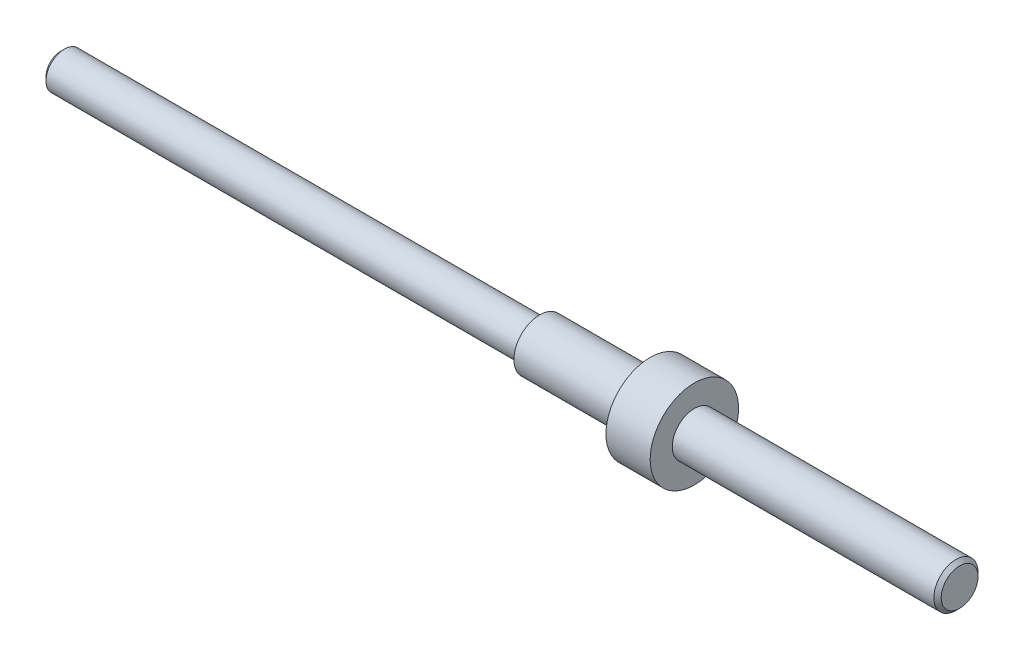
ISO-10303-21;
HEADER;
FILE_DESCRIPTION(('STEP AP214'),'2;1');
FILE_NAME('part.step','',(''),(''),'','','');
FILE_SCHEMA(('AUTOMOTIVE_DESIGN { 1 0 10303 214 1 1 1 1 }'));
ENDSEC;
DATA;
#1=APPLICATION_CONTEXT('core data for automotive mechanical design processes');
#2=APPLICATION_PROTOCOL_DEFINITION('international standard','automotive_design',2000,#1);
#3=PRODUCT_CONTEXT('',#1,'mechanical');
#4=PRODUCT('Part','Part','',(#3));
#5=PRODUCT_RELATED_PRODUCT_CATEGORY('part','',(#4));
#6=PRODUCT_DEFINITION_FORMATION('','',#4);
#7=PRODUCT_DEFINITION_CONTEXT('part definition',#1,'design');
#8=PRODUCT_DEFINITION('design','',#6,#7);
#9=PRODUCT_DEFINITION_SHAPE('','',#8);
#10=(LENGTH_UNIT() NAMED_UNIT(*) SI_UNIT(.MILLI.,.METRE.));
#11=(NAMED_UNIT(*) PLANE_ANGLE_UNIT() SI_UNIT($,.RADIAN.));
#12=(NAMED_UNIT(*) SI_UNIT($,.STERADIAN.) SOLID_ANGLE_UNIT());
#13=UNCERTAINTY_MEASURE_WITH_UNIT(LENGTH_MEASURE(1.E-05),#10,'distance_accuracy_value','');
#14=(GEOMETRIC_REPRESENTATION_CONTEXT(3) GLOBAL_UNCERTAINTY_ASSIGNED_CONTEXT((#13)) GLOBAL_UNIT_ASSIGNED_CONTEXT((#10,
#11,#12)) REPRESENTATION_CONTEXT('',''));
#15=CARTESIAN_POINT('',(0.,0.,0.));
#16=DIRECTION('',(0.,0.,1.));
#17=DIRECTION('',(1.,0.,0.));
#18=AXIS2_PLACEMENT_3D('',#15,#16,#17);
#19=CARTESIAN_POINT('',(0.,0.,0.));
#20=DIRECTION('',(-1.,0.,0.));
#21=DIRECTION('',(0.,0.,1.));
#22=AXIS2_PLACEMENT_3D('',#19,#20,#21);
#23=PLANE('',#22);
#24=CARTESIAN_POINT('',(0.,0.,0.));
#25=DIRECTION('',(-1.,0.,0.));
#26=DIRECTION('',(0.,0.,1.));
#27=AXIS2_PLACEMENT_3D('',#24,#25,#26);
#28=CIRCLE('',#27,2.5);
#29=CARTESIAN_POINT('',(0.,0.,2.5));
#30=VERTEX_POINT('',#29);
#31=EDGE_CURVE('E10',#30,#30,#28,.F.);
#32=ORIENTED_EDGE('',*,*,#31,.T.);
#33=EDGE_LOOP('',(#32));
#34=FACE_BOUND('',#33,.T.);
#35=ADVANCED_FACE('F29',(#34),#23,.F.);
#36=CARTESIAN_POINT('',(-122.,0.,0.));
#37=DIRECTION('',(-1.,0.,0.));
#38=DIRECTION('',(0.,0.,1.));
#39=AXIS2_PLACEMENT_3D('',#36,#37,#38);
#40=CYLINDRICAL_SURFACE('',#39,3.);
#41=CARTESIAN_POINT('',(-0.5,0.,0.));
#42=DIRECTION('',(-1.,0.,0.));
#43=DIRECTION('',(0.,0.,1.));
#44=AXIS2_PLACEMENT_3D('',#41,#42,#43);
#45=CIRCLE('',#44,3.);
#46=CARTESIAN_POINT('',(-0.5,0.,3.));
#47=VERTEX_POINT('',#46);
#48=EDGE_CURVE('E35',#47,#47,#45,.T.);
#49=ORIENTED_EDGE('',*,*,#48,.T.);
#50=EDGE_LOOP('',(#49));
#51=FACE_BOUND('',#50,.T.);
#52=CARTESIAN_POINT('',(-36.,0.,0.));
#53=DIRECTION('',(-1.,0.,0.));
#54=DIRECTION('',(0.,0.,1.));
#55=AXIS2_PLACEMENT_3D('',#52,#53,#54);
#56=CIRCLE('',#55,3.);
#57=CARTESIAN_POINT('',(-36.,0.,3.));
#58=VERTEX_POINT('',#57);
#59=EDGE_CURVE('E48',#58,#58,#56,.T.);
#60=ORIENTED_EDGE('',*,*,#59,.F.);
#61=EDGE_LOOP('',(#60));
#62=FACE_BOUND('',#61,.T.);
#63=ADVANCED_FACE('F96',(#51,#62),#40,.T.);
#64=CARTESIAN_POINT('',(-36.,3.,0.));
#65=DIRECTION('',(-1.,0.,0.));
#66=DIRECTION('',(0.,0.,1.));
#67=AXIS2_PLACEMENT_3D('',#64,#65,#66);
#68=PLANE('',#67);
#69=CARTESIAN_POINT('',(-36.,0.,0.));
#70=DIRECTION('',(-1.,0.,0.));
#71=DIRECTION('',(0.,0.,1.));
#72=AXIS2_PLACEMENT_3D('',#69,#70,#71);
#73=CIRCLE('',#72,6.);
#74=CARTESIAN_POINT('',(-36.,0.,6.));
#75=VERTEX_POINT('',#74);
#76=EDGE_CURVE('E51',#75,#75,#73,.T.);
#77=ORIENTED_EDGE('',*,*,#76,.F.);
#78=EDGE_LOOP('',(#77));
#79=FACE_BOUND('',#78,.T.);
#80=ORIENTED_EDGE('',*,*,#59,.T.);
#81=EDGE_LOOP('',(#80));
#82=FACE_BOUND('',#81,.T.);
#83=ADVANCED_FACE('F90',(#79,#82),#68,.F.);
#84=CARTESIAN_POINT('',(-122.,0.,0.));
#85=DIRECTION('',(-1.,0.,0.));
#86=DIRECTION('',(0.,0.,1.));
#87=AXIS2_PLACEMENT_3D('',#84,#85,#86);
#88=CYLINDRICAL_SURFACE('',#87,6.);
#89=CARTESIAN_POINT('',(-42.,0.,0.));
#90=DIRECTION('',(-1.,0.,0.));
#91=DIRECTION('',(0.,0.,1.));
#92=AXIS2_PLACEMENT_3D('',#89,#90,#91);
#93=CIRCLE('',#92,6.);
#94=CARTESIAN_POINT('',(-42.,0.,6.));
#95=VERTEX_POINT('',#94);
#96=EDGE_CURVE('E54',#95,#95,#93,.T.);
#97=ORIENTED_EDGE('',*,*,#96,.F.);
#98=EDGE_LOOP('',(#97));
#99=FACE_BOUND('',#98,.T.);
#100=ORIENTED_EDGE('',*,*,#76,.T.);
#101=EDGE_LOOP('',(#100));
#102=FACE_BOUND('',#101,.T.);
#103=ADVANCED_FACE('F84',(#99,#102),#88,.T.);
#104=CARTESIAN_POINT('',(-42.,6.,0.));
#105=DIRECTION('',(1.,0.,0.));
#106=DIRECTION('',(0.,0.,-1.));
#107=AXIS2_PLACEMENT_3D('',#104,#105,#106);
#108=PLANE('',#107);
#109=CARTESIAN_POINT('',(-42.,0.,0.));
#110=DIRECTION('',(-1.,0.,0.));
#111=DIRECTION('',(0.,0.,1.));
#112=AXIS2_PLACEMENT_3D('',#109,#110,#111);
#113=CIRCLE('',#112,3.5);
#114=CARTESIAN_POINT('',(-42.,0.,3.5));
#115=VERTEX_POINT('',#114);
#116=EDGE_CURVE('E57',#115,#115,#113,.T.);
#117=ORIENTED_EDGE('',*,*,#116,.F.);
#118=EDGE_LOOP('',(#117));
#119=FACE_BOUND('',#118,.T.);
#120=ORIENTED_EDGE('',*,*,#96,.T.);
#121=EDGE_LOOP('',(#120));
#122=FACE_BOUND('',#121,.T.);
#123=ADVANCED_FACE('F78',(#119,#122),#108,.F.);
#124=CARTESIAN_POINT('',(-122.,0.,0.));
#125=DIRECTION('',(-1.,0.,0.));
#126=DIRECTION('',(0.,0.,1.));
#127=AXIS2_PLACEMENT_3D('',#124,#125,#126);
#128=CYLINDRICAL_SURFACE('',#127,3.5);
#129=CARTESIAN_POINT('',(-57.,0.,0.));
#130=DIRECTION('',(-1.,0.,0.));
#131=DIRECTION('',(0.,0.,1.));
#132=AXIS2_PLACEMENT_3D('',#129,#130,#131);
#133=CIRCLE('',#132,3.5);
#134=CARTESIAN_POINT('',(-57.,0.,3.5));
#135=VERTEX_POINT('',#134);
#136=EDGE_CURVE('E60',#135,#135,#133,.T.);
#137=ORIENTED_EDGE('',*,*,#136,.F.);
#138=EDGE_LOOP('',(#137));
#139=FACE_BOUND('',#138,.T.);
#140=ORIENTED_EDGE('',*,*,#116,.T.);
#141=EDGE_LOOP('',(#140));
#142=FACE_BOUND('',#141,.T.);
#143=ADVANCED_FACE('F72',(#139,#142),#128,.T.);
#144=CARTESIAN_POINT('',(-57.,3.5,0.));
#145=DIRECTION('',(1.,0.,0.));
#146=DIRECTION('',(0.,0.,-1.));
#147=AXIS2_PLACEMENT_3D('',#144,#145,#146);
#148=PLANE('',#147);
#149=CARTESIAN_POINT('',(-57.,0.,0.));
#150=DIRECTION('',(-1.,0.,0.));
#151=DIRECTION('',(0.,0.,1.));
#152=AXIS2_PLACEMENT_3D('',#149,#150,#151);
#153=CIRCLE('',#152,2.5);
#154=CARTESIAN_POINT('',(-57.,0.,2.5));
#155=VERTEX_POINT('',#154);
#156=EDGE_CURVE('E63',#155,#155,#153,.T.);
#157=ORIENTED_EDGE('',*,*,#156,.F.);
#158=EDGE_LOOP('',(#157));
#159=FACE_BOUND('',#158,.T.);
#160=ORIENTED_EDGE('',*,*,#136,.T.);
#161=EDGE_LOOP('',(#160));
#162=FACE_BOUND('',#161,.T.);
#163=ADVANCED_FACE('F69',(#159,#162),#148,.F.);
#164=CARTESIAN_POINT('',(-122.,0.,0.));
#165=DIRECTION('',(-1.,0.,0.));
#166=DIRECTION('',(0.,0.,1.));
#167=AXIS2_PLACEMENT_3D('',#164,#165,#166);
#168=CYLINDRICAL_SURFACE('',#167,2.5);
#169=CARTESIAN_POINT('',(-121.5,0.,0.));
#170=DIRECTION('',(1.,0.,0.));
#171=DIRECTION('',(0.,0.,-1.));
#172=AXIS2_PLACEMENT_3D('',#169,#170,#171);
#173=CIRCLE('',#172,2.5);
#174=CARTESIAN_POINT('',(-121.5,0.,-2.5));
#175=VERTEX_POINT('',#174);
#176=EDGE_CURVE('E39',#175,#175,#173,.T.);
#177=ORIENTED_EDGE('',*,*,#176,.T.);
#178=EDGE_LOOP('',(#177));
#179=FACE_BOUND('',#178,.T.);
#180=ORIENTED_EDGE('',*,*,#156,.T.);
#181=EDGE_LOOP('',(#180));
#182=FACE_BOUND('',#181,.T.);
#183=ADVANCED_FACE('F67',(#179,#182),#168,.T.);
#184=CARTESIAN_POINT('',(-122.,2.49999999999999,0.));
#185=DIRECTION('',(1.,0.,0.));
#186=DIRECTION('',(0.,0.,-1.));
#187=AXIS2_PLACEMENT_3D('',#184,#185,#186);
#188=PLANE('',#187);
#189=CARTESIAN_POINT('',(-122.,0.,0.));
#190=DIRECTION('',(1.,0.,0.));
#191=DIRECTION('',(0.,0.,-1.));
#192=AXIS2_PLACEMENT_3D('',#189,#190,#191);
#193=CIRCLE('',#192,1.99999999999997);
#194=CARTESIAN_POINT('',(-122.,0.,-1.99999999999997));
#195=VERTEX_POINT('',#194);
#196=EDGE_CURVE('E43',#195,#195,#193,.F.);
#197=ORIENTED_EDGE('',*,*,#196,.T.);
#198=EDGE_LOOP('',(#197));
#199=FACE_BOUND('',#198,.T.);
#200=ADVANCED_FACE('F107',(#199),#188,.F.);
#201=CARTESIAN_POINT('',(-122.,0.,0.));
#202=DIRECTION('',(1.,0.,0.));
#203=DIRECTION('',(0.,0.,-1.));
#204=AXIS2_PLACEMENT_3D('',#201,#202,#203);
#205=CONICAL_SURFACE('',#204,1.99999999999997,0.785398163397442);
#206=ORIENTED_EDGE('',*,*,#176,.F.);
#207=EDGE_LOOP('',(#206));
#208=FACE_BOUND('',#207,.T.);
#209=ORIENTED_EDGE('',*,*,#196,.F.);
#210=EDGE_LOOP('',(#209));
#211=FACE_BOUND('',#210,.T.);
#212=ADVANCED_FACE('F111',(#208,#211),#205,.T.);
#213=CARTESIAN_POINT('',(-0.5,0.,0.));
#214=DIRECTION('',(-1.,0.,0.));
#215=DIRECTION('',(0.,0.,1.));
#216=AXIS2_PLACEMENT_3D('',#213,#214,#215);
#217=CONICAL_SURFACE('',#216,3.,0.785398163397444);
#218=ORIENTED_EDGE('',*,*,#31,.F.);
#219=EDGE_LOOP('',(#218));
#220=FACE_BOUND('',#219,.T.);
#221=ORIENTED_EDGE('',*,*,#48,.F.);
#222=EDGE_LOOP('',(#221));
#223=FACE_BOUND('',#222,.T.);
#224=ADVANCED_FACE('F115',(#220,#223),#217,.T.);
#225=CLOSED_SHELL('',(#35,#63,#83,#103,#123,#143,#163,#183,#200,#212,#224));
#226=MANIFOLD_SOLID_BREP('B2',#225);
#227=ADVANCED_BREP_SHAPE_REPRESENTATION('',(#18,#226),#14);
#228=SHAPE_DEFINITION_REPRESENTATION(#9,#227);
ENDSEC;
END-ISO-10303-21;
